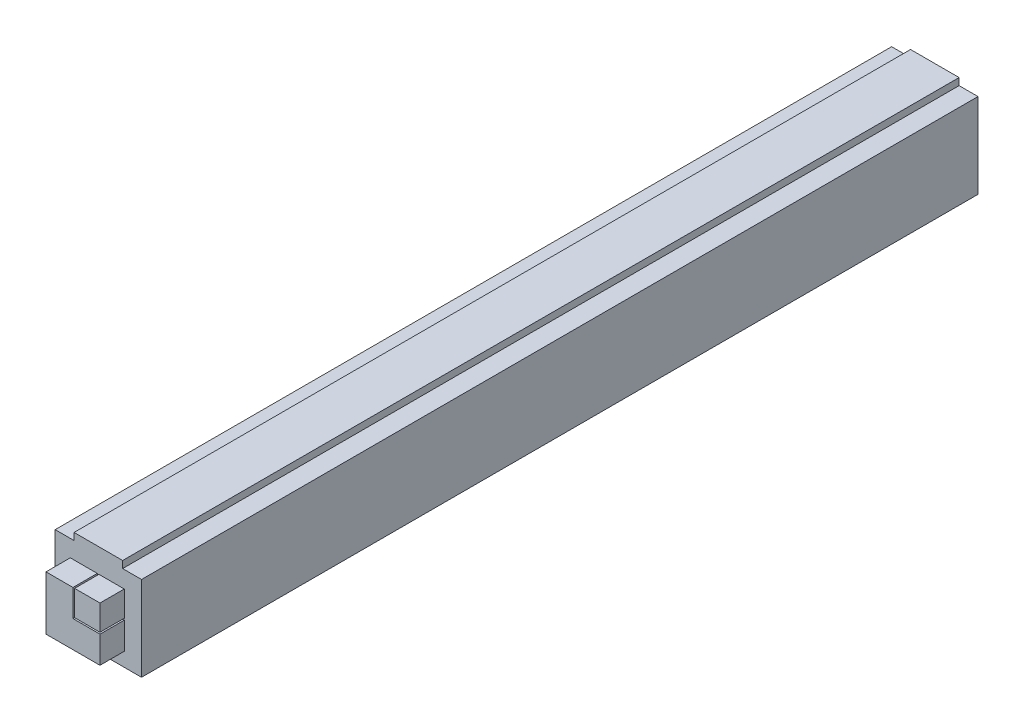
ISO-10303-21;
HEADER;
FILE_DESCRIPTION(('STEP AP214'),'2;1');
FILE_NAME('part.step','',(''),(''),'','','');
FILE_SCHEMA(('AUTOMOTIVE_DESIGN { 1 0 10303 214 1 1 1 1 }'));
ENDSEC;
DATA;
#1=APPLICATION_CONTEXT('core data for automotive mechanical design processes');
#2=APPLICATION_PROTOCOL_DEFINITION('international standard','automotive_design',2000,#1);
#3=PRODUCT_CONTEXT('',#1,'mechanical');
#4=PRODUCT('Part','Part','',(#3));
#5=PRODUCT_RELATED_PRODUCT_CATEGORY('part','',(#4));
#6=PRODUCT_DEFINITION_FORMATION('','',#4);
#7=PRODUCT_DEFINITION_CONTEXT('part definition',#1,'design');
#8=PRODUCT_DEFINITION('design','',#6,#7);
#9=PRODUCT_DEFINITION_SHAPE('','',#8);
#10=(LENGTH_UNIT() NAMED_UNIT(*) SI_UNIT(.MILLI.,.METRE.));
#11=(NAMED_UNIT(*) PLANE_ANGLE_UNIT() SI_UNIT($,.RADIAN.));
#12=(NAMED_UNIT(*) SI_UNIT($,.STERADIAN.) SOLID_ANGLE_UNIT());
#13=UNCERTAINTY_MEASURE_WITH_UNIT(LENGTH_MEASURE(1.E-05),#10,'distance_accuracy_value','');
#14=(GEOMETRIC_REPRESENTATION_CONTEXT(3) GLOBAL_UNCERTAINTY_ASSIGNED_CONTEXT((#13)) GLOBAL_UNIT_ASSIGNED_CONTEXT((#10,
#11,#12)) REPRESENTATION_CONTEXT('',''));
#15=CARTESIAN_POINT('',(0.,0.,0.));
#16=DIRECTION('',(0.,0.,1.));
#17=DIRECTION('',(1.,0.,0.));
#18=AXIS2_PLACEMENT_3D('',#15,#16,#17);
#19=CARTESIAN_POINT('',(0.30139237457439,25.5354081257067,-0.300000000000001));
#20=DIRECTION('',(0.,-1.,0.));
#21=DIRECTION('',(0.,0.,-1.));
#22=AXIS2_PLACEMENT_3D('',#19,#20,#21);
#23=PLANE('',#22);
#24=DIRECTION('',(-1.,0.,0.));
#25=VECTOR('',#24,1.);
#26=CARTESIAN_POINT('',(0.30139237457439,25.5354081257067,-4.8));
#27=LINE('',#26,#25);
#28=CARTESIAN_POINT('',(5.,25.5354081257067,-4.8));
#29=VERTEX_POINT('',#28);
#30=CARTESIAN_POINT('',(0.30139237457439,25.5354081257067,-4.8));
#31=VERTEX_POINT('',#30);
#32=EDGE_CURVE('E108',#29,#31,#27,.T.);
#33=ORIENTED_EDGE('',*,*,#32,.T.);
#34=DIRECTION('',(0.,0.,-1.));
#35=VECTOR('',#34,1.);
#36=CARTESIAN_POINT('',(0.30139237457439,25.5354081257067,-0.300000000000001));
#37=LINE('',#36,#35);
#38=CARTESIAN_POINT('',(0.30139237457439,25.5354081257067,-0.300000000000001));
#39=VERTEX_POINT('',#38);
#40=EDGE_CURVE('E12',#39,#31,#37,.T.);
#41=ORIENTED_EDGE('',*,*,#40,.F.);
#42=DIRECTION('',(-1.,0.,0.));
#43=VECTOR('',#42,1.);
#44=CARTESIAN_POINT('',(0.30139237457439,25.5354081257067,-0.300000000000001));
#45=LINE('',#44,#43);
#46=CARTESIAN_POINT('',(5.,25.5354081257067,-0.300000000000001));
#47=VERTEX_POINT('',#46);
#48=EDGE_CURVE('E96',#47,#39,#45,.T.);
#49=ORIENTED_EDGE('',*,*,#48,.F.);
#50=DIRECTION('',(0.,0.,-1.));
#51=VECTOR('',#50,1.);
#52=CARTESIAN_POINT('',(5.,25.5354081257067,-0.300000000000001));
#53=LINE('',#52,#51);
#54=EDGE_CURVE('E104',#47,#29,#53,.T.);
#55=ORIENTED_EDGE('',*,*,#54,.T.);
#56=EDGE_LOOP('',(#33,#41,#49,#55));
#57=FACE_BOUND('',#56,.T.);
#58=ADVANCED_FACE('F45',(#57),#23,.F.);
#59=CARTESIAN_POINT('',(0.30139237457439,25.5354081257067,-0.300000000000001));
#60=DIRECTION('',(1.,0.,0.));
#61=DIRECTION('',(0.,1.,0.));
#62=AXIS2_PLACEMENT_3D('',#59,#60,#61);
#63=PLANE('',#62);
#64=DIRECTION('',(0.,-1.,0.));
#65=VECTOR('',#64,1.);
#66=CARTESIAN_POINT('',(0.30139237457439,25.5354081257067,-4.8));
#67=LINE('',#66,#65);
#68=CARTESIAN_POINT('',(0.301392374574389,20.836800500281,-4.8));
#69=VERTEX_POINT('',#68);
#70=EDGE_CURVE('E100',#31,#69,#67,.T.);
#71=ORIENTED_EDGE('',*,*,#70,.T.);
#72=DIRECTION('',(0.,0.,-1.));
#73=VECTOR('',#72,1.);
#74=CARTESIAN_POINT('',(0.301392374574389,20.836800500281,-0.300000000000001));
#75=LINE('',#74,#73);
#76=CARTESIAN_POINT('',(0.301392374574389,20.836800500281,-0.300000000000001));
#77=VERTEX_POINT('',#76);
#78=EDGE_CURVE('E53',#77,#69,#75,.T.);
#79=ORIENTED_EDGE('',*,*,#78,.F.);
#80=DIRECTION('',(0.,-1.,0.));
#81=VECTOR('',#80,1.);
#82=CARTESIAN_POINT('',(0.30139237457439,25.5354081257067,-0.300000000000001));
#83=LINE('',#82,#81);
#84=EDGE_CURVE('E91',#39,#77,#83,.T.);
#85=ORIENTED_EDGE('',*,*,#84,.F.);
#86=ORIENTED_EDGE('',*,*,#40,.T.);
#87=EDGE_LOOP('',(#71,#79,#85,#86));
#88=FACE_BOUND('',#87,.T.);
#89=ADVANCED_FACE('F99',(#88),#63,.F.);
#90=CARTESIAN_POINT('',(0.301392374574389,20.836800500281,-0.300000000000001));
#91=DIRECTION('',(0.,1.,0.));
#92=DIRECTION('',(0.,0.,1.));
#93=AXIS2_PLACEMENT_3D('',#90,#91,#92);
#94=PLANE('',#93);
#95=DIRECTION('',(1.,0.,0.));
#96=VECTOR('',#95,1.);
#97=CARTESIAN_POINT('',(0.301392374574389,20.836800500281,-4.8));
#98=LINE('',#97,#96);
#99=CARTESIAN_POINT('',(5.,20.836800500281,-4.8));
#100=VERTEX_POINT('',#99);
#101=EDGE_CURVE('E78',#69,#100,#98,.T.);
#102=ORIENTED_EDGE('',*,*,#101,.T.);
#103=DIRECTION('',(0.,0.,-1.));
#104=VECTOR('',#103,1.);
#105=CARTESIAN_POINT('',(5.,20.836800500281,-0.300000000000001));
#106=LINE('',#105,#104);
#107=CARTESIAN_POINT('',(5.,20.836800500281,-0.300000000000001));
#108=VERTEX_POINT('',#107);
#109=EDGE_CURVE('E101',#108,#100,#106,.T.);
#110=ORIENTED_EDGE('',*,*,#109,.F.);
#111=DIRECTION('',(1.,0.,0.));
#112=VECTOR('',#111,1.);
#113=CARTESIAN_POINT('',(0.301392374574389,20.836800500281,-0.300000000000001));
#114=LINE('',#113,#112);
#115=EDGE_CURVE('E94',#77,#108,#114,.T.);
#116=ORIENTED_EDGE('',*,*,#115,.F.);
#117=ORIENTED_EDGE('',*,*,#78,.T.);
#118=EDGE_LOOP('',(#102,#110,#116,#117));
#119=FACE_BOUND('',#118,.T.);
#120=ADVANCED_FACE('F102',(#119),#94,.F.);
#121=CARTESIAN_POINT('',(5.,25.5354081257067,-0.300000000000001));
#122=DIRECTION('',(-1.,0.,0.));
#123=DIRECTION('',(0.,-1.,0.));
#124=AXIS2_PLACEMENT_3D('',#121,#122,#123);
#125=PLANE('',#124);
#126=DIRECTION('',(0.,1.,0.));
#127=VECTOR('',#126,1.);
#128=CARTESIAN_POINT('',(5.,25.5354081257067,-4.8));
#129=LINE('',#128,#127);
#130=EDGE_CURVE('E84',#100,#29,#129,.T.);
#131=ORIENTED_EDGE('',*,*,#130,.T.);
#132=ORIENTED_EDGE('',*,*,#54,.F.);
#133=DIRECTION('',(0.,1.,0.));
#134=VECTOR('',#133,1.);
#135=CARTESIAN_POINT('',(5.,25.5354081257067,-0.300000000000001));
#136=LINE('',#135,#134);
#137=EDGE_CURVE('E61',#108,#47,#136,.T.);
#138=ORIENTED_EDGE('',*,*,#137,.F.);
#139=ORIENTED_EDGE('',*,*,#109,.T.);
#140=EDGE_LOOP('',(#131,#132,#138,#139));
#141=FACE_BOUND('',#140,.T.);
#142=ADVANCED_FACE('F115',(#141),#125,.F.);
#143=CARTESIAN_POINT('',(0.,0.,-0.300000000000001));
#144=DIRECTION('',(0.,0.,-1.));
#145=DIRECTION('',(-1.,0.,0.));
#146=AXIS2_PLACEMENT_3D('',#143,#144,#145);
#147=PLANE('',#146);
#148=ORIENTED_EDGE('',*,*,#48,.T.);
#149=ORIENTED_EDGE('',*,*,#84,.T.);
#150=ORIENTED_EDGE('',*,*,#115,.T.);
#151=ORIENTED_EDGE('',*,*,#137,.T.);
#152=EDGE_LOOP('',(#148,#149,#150,#151));
#153=FACE_BOUND('',#152,.T.);
#154=ADVANCED_FACE('F92',(#153),#147,.F.);
#155=CARTESIAN_POINT('',(0.,0.,-4.8));
#156=DIRECTION('',(0.,0.,-1.));
#157=DIRECTION('',(-1.,0.,0.));
#158=AXIS2_PLACEMENT_3D('',#155,#156,#157);
#159=PLANE('',#158);
#160=ORIENTED_EDGE('',*,*,#32,.F.);
#161=ORIENTED_EDGE('',*,*,#130,.F.);
#162=ORIENTED_EDGE('',*,*,#101,.F.);
#163=ORIENTED_EDGE('',*,*,#70,.F.);
#164=EDGE_LOOP('',(#160,#161,#162,#163));
#165=FACE_BOUND('',#164,.T.);
#166=ADVANCED_FACE('F118',(#165),#159,.T.);
#167=CLOSED_SHELL('',(#58,#89,#120,#142,#154,#166));
#168=MANIFOLD_SOLID_BREP('B2',#167);
#169=CARTESIAN_POINT('',(5.,20.5354081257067,-0.300000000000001));
#170=DIRECTION('',(-1.,0.,0.));
#171=DIRECTION('',(0.,-1.,0.));
#172=AXIS2_PLACEMENT_3D('',#169,#170,#171);
#173=PLANE('',#172);
#174=DIRECTION('',(0.,1.,0.));
#175=VECTOR('',#174,1.);
#176=CARTESIAN_POINT('',(5.,20.5354081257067,-4.8));
#177=LINE('',#176,#175);
#178=CARTESIAN_POINT('',(5.,15.5354081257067,-4.8));
#179=VERTEX_POINT('',#178);
#180=CARTESIAN_POINT('',(5.,20.5354081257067,-4.8));
#181=VERTEX_POINT('',#180);
#182=EDGE_CURVE('E261',#179,#181,#177,.T.);
#183=ORIENTED_EDGE('',*,*,#182,.T.);
#184=DIRECTION('',(0.,0.,-1.));
#185=VECTOR('',#184,1.);
#186=CARTESIAN_POINT('',(5.,20.5354081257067,-0.300000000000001));
#187=LINE('',#186,#185);
#188=CARTESIAN_POINT('',(5.,20.5354081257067,-0.300000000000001));
#189=VERTEX_POINT('',#188);
#190=EDGE_CURVE('E43',#189,#181,#187,.T.);
#191=ORIENTED_EDGE('',*,*,#190,.F.);
#192=DIRECTION('',(0.,1.,0.));
#193=VECTOR('',#192,1.);
#194=CARTESIAN_POINT('',(5.,20.5354081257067,-0.300000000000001));
#195=LINE('',#194,#193);
#196=CARTESIAN_POINT('',(5.,15.5354081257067,-0.300000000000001));
#197=VERTEX_POINT('',#196);
#198=EDGE_CURVE('E271',#197,#189,#195,.T.);
#199=ORIENTED_EDGE('',*,*,#198,.F.);
#200=DIRECTION('',(0.,0.,-1.));
#201=VECTOR('',#200,1.);
#202=CARTESIAN_POINT('',(5.,15.5354081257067,-0.300000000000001));
#203=LINE('',#202,#201);
#204=EDGE_CURVE('E257',#197,#179,#203,.T.);
#205=ORIENTED_EDGE('',*,*,#204,.T.);
#206=EDGE_LOOP('',(#183,#191,#199,#205));
#207=FACE_BOUND('',#206,.T.);
#208=ADVANCED_FACE('F177',(#207),#173,.F.);
#209=CARTESIAN_POINT('',(0.,20.5354081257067,-0.300000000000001));
#210=DIRECTION('',(0.,-1.,0.));
#211=DIRECTION('',(1.,0.,0.));
#212=AXIS2_PLACEMENT_3D('',#209,#210,#211);
#213=PLANE('',#212);
#214=DIRECTION('',(-1.,0.,0.));
#215=VECTOR('',#214,1.);
#216=CARTESIAN_POINT('',(0.,20.5354081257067,-4.8));
#217=LINE('',#216,#215);
#218=CARTESIAN_POINT('',(0.,20.5354081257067,-4.8));
#219=VERTEX_POINT('',#218);
#220=EDGE_CURVE('E264',#181,#219,#217,.T.);
#221=ORIENTED_EDGE('',*,*,#220,.T.);
#222=DIRECTION('',(0.,0.,-1.));
#223=VECTOR('',#222,1.);
#224=CARTESIAN_POINT('',(0.,20.5354081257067,-0.300000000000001));
#225=LINE('',#224,#223);
#226=CARTESIAN_POINT('',(0.,20.5354081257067,-0.300000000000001));
#227=VERTEX_POINT('',#226);
#228=EDGE_CURVE('E185',#227,#219,#225,.T.);
#229=ORIENTED_EDGE('',*,*,#228,.F.);
#230=DIRECTION('',(-1.,0.,0.));
#231=VECTOR('',#230,1.);
#232=CARTESIAN_POINT('',(0.,20.5354081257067,-0.300000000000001));
#233=LINE('',#232,#231);
#234=EDGE_CURVE('E230',#189,#227,#233,.T.);
#235=ORIENTED_EDGE('',*,*,#234,.F.);
#236=ORIENTED_EDGE('',*,*,#190,.T.);
#237=EDGE_LOOP('',(#221,#229,#235,#236));
#238=FACE_BOUND('',#237,.T.);
#239=ADVANCED_FACE('F295',(#238),#213,.F.);
#240=CARTESIAN_POINT('',(0.,25.5354081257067,-0.300000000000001));
#241=DIRECTION('',(-1.,0.,0.));
#242=DIRECTION('',(0.,-1.,0.));
#243=AXIS2_PLACEMENT_3D('',#240,#241,#242);
#244=PLANE('',#243);
#245=DIRECTION('',(0.,1.,0.));
#246=VECTOR('',#245,1.);
#247=CARTESIAN_POINT('',(0.,25.5354081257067,-4.8));
#248=LINE('',#247,#246);
#249=CARTESIAN_POINT('',(0.,25.5354081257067,-4.8));
#250=VERTEX_POINT('',#249);
#251=EDGE_CURVE('E266',#219,#250,#248,.T.);
#252=ORIENTED_EDGE('',*,*,#251,.T.);
#253=DIRECTION('',(0.,0.,-1.));
#254=VECTOR('',#253,1.);
#255=CARTESIAN_POINT('',(0.,25.5354081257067,-0.300000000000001));
#256=LINE('',#255,#254);
#257=CARTESIAN_POINT('',(0.,25.5354081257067,-0.300000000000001));
#258=VERTEX_POINT('',#257);
#259=EDGE_CURVE('E252',#258,#250,#256,.T.);
#260=ORIENTED_EDGE('',*,*,#259,.F.);
#261=DIRECTION('',(0.,1.,0.));
#262=VECTOR('',#261,1.);
#263=CARTESIAN_POINT('',(0.,25.5354081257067,-0.300000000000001));
#264=LINE('',#263,#262);
#265=EDGE_CURVE('E243',#227,#258,#264,.T.);
#266=ORIENTED_EDGE('',*,*,#265,.F.);
#267=ORIENTED_EDGE('',*,*,#228,.T.);
#268=EDGE_LOOP('',(#252,#260,#266,#267));
#269=FACE_BOUND('',#268,.T.);
#270=ADVANCED_FACE('F277',(#269),#244,.F.);
#271=CARTESIAN_POINT('',(-5.,25.5354081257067,-0.300000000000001));
#272=DIRECTION('',(0.,-1.,0.));
#273=DIRECTION('',(0.,0.,-1.));
#274=AXIS2_PLACEMENT_3D('',#271,#272,#273);
#275=PLANE('',#274);
#276=DIRECTION('',(-1.,0.,0.));
#277=VECTOR('',#276,1.);
#278=CARTESIAN_POINT('',(-5.,25.5354081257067,-4.8));
#279=LINE('',#278,#277);
#280=CARTESIAN_POINT('',(-5.,25.5354081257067,-4.8));
#281=VERTEX_POINT('',#280);
#282=EDGE_CURVE('E251',#250,#281,#279,.T.);
#283=ORIENTED_EDGE('',*,*,#282,.T.);
#284=DIRECTION('',(0.,0.,-1.));
#285=VECTOR('',#284,1.);
#286=CARTESIAN_POINT('',(-5.,25.5354081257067,-0.300000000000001));
#287=LINE('',#286,#285);
#288=CARTESIAN_POINT('',(-5.,25.5354081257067,-0.300000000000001));
#289=VERTEX_POINT('',#288);
#290=EDGE_CURVE('E248',#289,#281,#287,.T.);
#291=ORIENTED_EDGE('',*,*,#290,.F.);
#292=DIRECTION('',(-1.,0.,0.));
#293=VECTOR('',#292,1.);
#294=CARTESIAN_POINT('',(-5.,25.5354081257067,-0.300000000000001));
#295=LINE('',#294,#293);
#296=EDGE_CURVE('E237',#258,#289,#295,.T.);
#297=ORIENTED_EDGE('',*,*,#296,.F.);
#298=ORIENTED_EDGE('',*,*,#259,.T.);
#299=EDGE_LOOP('',(#283,#291,#297,#298));
#300=FACE_BOUND('',#299,.T.);
#301=ADVANCED_FACE('F249',(#300),#275,.F.);
#302=CARTESIAN_POINT('',(-5.,25.5354081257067,-0.300000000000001));
#303=DIRECTION('',(1.,0.,0.));
#304=DIRECTION('',(0.,0.,-1.));
#305=AXIS2_PLACEMENT_3D('',#302,#303,#304);
#306=PLANE('',#305);
#307=DIRECTION('',(0.,-1.,0.));
#308=VECTOR('',#307,1.);
#309=CARTESIAN_POINT('',(-5.,25.5354081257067,-4.8));
#310=LINE('',#309,#308);
#311=CARTESIAN_POINT('',(-5.,15.5354081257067,-4.8));
#312=VERTEX_POINT('',#311);
#313=EDGE_CURVE('E216',#281,#312,#310,.T.);
#314=ORIENTED_EDGE('',*,*,#313,.T.);
#315=DIRECTION('',(0.,0.,-1.));
#316=VECTOR('',#315,1.);
#317=CARTESIAN_POINT('',(-5.,15.5354081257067,-0.300000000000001));
#318=LINE('',#317,#316);
#319=CARTESIAN_POINT('',(-5.,15.5354081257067,-0.300000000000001));
#320=VERTEX_POINT('',#319);
#321=EDGE_CURVE('E253',#320,#312,#318,.T.);
#322=ORIENTED_EDGE('',*,*,#321,.F.);
#323=DIRECTION('',(0.,-1.,0.));
#324=VECTOR('',#323,1.);
#325=CARTESIAN_POINT('',(-5.,25.5354081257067,-0.300000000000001));
#326=LINE('',#325,#324);
#327=EDGE_CURVE('E241',#289,#320,#326,.T.);
#328=ORIENTED_EDGE('',*,*,#327,.F.);
#329=ORIENTED_EDGE('',*,*,#290,.T.);
#330=EDGE_LOOP('',(#314,#322,#328,#329));
#331=FACE_BOUND('',#330,.T.);
#332=ADVANCED_FACE('F255',(#331),#306,.F.);
#333=CARTESIAN_POINT('',(-5.,15.5354081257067,-0.300000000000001));
#334=DIRECTION('',(0.,1.,0.));
#335=DIRECTION('',(0.,0.,1.));
#336=AXIS2_PLACEMENT_3D('',#333,#334,#335);
#337=PLANE('',#336);
#338=DIRECTION('',(1.,0.,0.));
#339=VECTOR('',#338,1.);
#340=CARTESIAN_POINT('',(-5.,15.5354081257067,-4.8));
#341=LINE('',#340,#339);
#342=EDGE_CURVE('E222',#312,#179,#341,.T.);
#343=ORIENTED_EDGE('',*,*,#342,.T.);
#344=ORIENTED_EDGE('',*,*,#204,.F.);
#345=DIRECTION('',(1.,0.,0.));
#346=VECTOR('',#345,1.);
#347=CARTESIAN_POINT('',(-5.,15.5354081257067,-0.300000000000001));
#348=LINE('',#347,#346);
#349=EDGE_CURVE('E193',#320,#197,#348,.T.);
#350=ORIENTED_EDGE('',*,*,#349,.F.);
#351=ORIENTED_EDGE('',*,*,#321,.T.);
#352=EDGE_LOOP('',(#343,#344,#350,#351));
#353=FACE_BOUND('',#352,.T.);
#354=ADVANCED_FACE('F284',(#353),#337,.F.);
#355=CARTESIAN_POINT('',(0.,0.,-0.300000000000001));
#356=DIRECTION('',(0.,0.,1.));
#357=DIRECTION('',(1.,0.,0.));
#358=AXIS2_PLACEMENT_3D('',#355,#356,#357);
#359=PLANE('',#358);
#360=ORIENTED_EDGE('',*,*,#198,.T.);
#361=ORIENTED_EDGE('',*,*,#234,.T.);
#362=ORIENTED_EDGE('',*,*,#265,.T.);
#363=ORIENTED_EDGE('',*,*,#296,.T.);
#364=ORIENTED_EDGE('',*,*,#327,.T.);
#365=ORIENTED_EDGE('',*,*,#349,.T.);
#366=EDGE_LOOP('',(#360,#361,#362,#363,#364,#365));
#367=FACE_BOUND('',#366,.T.);
#368=ADVANCED_FACE('F239',(#367),#359,.T.);
#369=CARTESIAN_POINT('',(0.,0.,-4.8));
#370=DIRECTION('',(0.,0.,1.));
#371=DIRECTION('',(1.,0.,0.));
#372=AXIS2_PLACEMENT_3D('',#369,#370,#371);
#373=PLANE('',#372);
#374=ORIENTED_EDGE('',*,*,#182,.F.);
#375=ORIENTED_EDGE('',*,*,#342,.F.);
#376=ORIENTED_EDGE('',*,*,#313,.F.);
#377=ORIENTED_EDGE('',*,*,#282,.F.);
#378=ORIENTED_EDGE('',*,*,#251,.F.);
#379=ORIENTED_EDGE('',*,*,#220,.F.);
#380=EDGE_LOOP('',(#374,#375,#376,#377,#378,#379));
#381=FACE_BOUND('',#380,.T.);
#382=ADVANCED_FACE('F280',(#381),#373,.F.);
#383=CLOSED_SHELL('',(#208,#239,#270,#301,#332,#354,#368,#382));
#384=MANIFOLD_SOLID_BREP('B6',#383);
#385=CARTESIAN_POINT('',(7.99999999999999,28.4606508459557,-160.));
#386=DIRECTION('',(1.,0.,0.));
#387=DIRECTION('',(0.,1.,0.));
#388=AXIS2_PLACEMENT_3D('',#385,#386,#387);
#389=PLANE('',#388);
#390=DIRECTION('',(0.,1.,0.));
#391=VECTOR('',#390,1.);
#392=CARTESIAN_POINT('',(7.99999999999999,28.4606508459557,-5.));
#393=LINE('',#392,#391);
#394=CARTESIAN_POINT('',(8.,12.7606508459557,-5.));
#395=VERTEX_POINT('',#394);
#396=CARTESIAN_POINT('',(7.99999999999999,28.4606508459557,-5.));
#397=VERTEX_POINT('',#396);
#398=EDGE_CURVE('E449',#395,#397,#393,.T.);
#399=ORIENTED_EDGE('',*,*,#398,.F.);
#400=DIRECTION('',(0.,0.,1.));
#401=VECTOR('',#400,1.);
#402=CARTESIAN_POINT('',(8.,12.7606508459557,-160.));
#403=LINE('',#402,#401);
#404=CARTESIAN_POINT('',(8.,12.7606508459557,-160.));
#405=VERTEX_POINT('',#404);
#406=EDGE_CURVE('E175',#405,#395,#403,.T.);
#407=ORIENTED_EDGE('',*,*,#406,.F.);
#408=DIRECTION('',(0.,1.,0.));
#409=VECTOR('',#408,1.);
#410=CARTESIAN_POINT('',(7.99999999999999,28.4606508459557,-160.));
#411=LINE('',#410,#409);
#412=CARTESIAN_POINT('',(7.99999999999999,28.4606508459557,-160.));
#413=VERTEX_POINT('',#412);
#414=EDGE_CURVE('E470',#405,#413,#411,.T.);
#415=ORIENTED_EDGE('',*,*,#414,.T.);
#416=DIRECTION('',(0.,0.,1.));
#417=VECTOR('',#416,1.);
#418=CARTESIAN_POINT('',(7.99999999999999,28.4606508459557,-160.));
#419=LINE('',#418,#417);
#420=EDGE_CURVE('E355',#413,#397,#419,.T.);
#421=ORIENTED_EDGE('',*,*,#420,.T.);
#422=EDGE_LOOP('',(#399,#407,#415,#421));
#423=FACE_BOUND('',#422,.T.);
#424=ADVANCED_FACE('F352',(#423),#389,.T.);
#425=CARTESIAN_POINT('',(-8.,12.7606508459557,-160.));
#426=DIRECTION('',(0.,-1.,0.));
#427=DIRECTION('',(0.,0.,-1.));
#428=AXIS2_PLACEMENT_3D('',#425,#426,#427);
#429=PLANE('',#428);
#430=CARTESIAN_POINT('',(0.,12.7606508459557,-82.4));
#431=DIRECTION('',(0.,-1.,0.));
#432=DIRECTION('',(0.,0.,-1.));
#433=AXIS2_PLACEMENT_3D('',#430,#431,#432);
#434=CIRCLE('',#433,6.65);
#435=CARTESIAN_POINT('',(0.,12.7606508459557,-89.05));
#436=VERTEX_POINT('',#435);
#437=EDGE_CURVE('E527',#436,#436,#434,.T.);
#438=ORIENTED_EDGE('',*,*,#437,.F.);
#439=EDGE_LOOP('',(#438));
#440=FACE_BOUND('',#439,.T.);
#441=DIRECTION('',(1.,0.,0.));
#442=VECTOR('',#441,1.);
#443=CARTESIAN_POINT('',(-8.,12.7606508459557,-5.));
#444=LINE('',#443,#442);
#445=CARTESIAN_POINT('',(-8.,12.7606508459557,-5.));
#446=VERTEX_POINT('',#445);
#447=EDGE_CURVE('E468',#446,#395,#444,.T.);
#448=ORIENTED_EDGE('',*,*,#447,.F.);
#449=DIRECTION('',(0.,0.,1.));
#450=VECTOR('',#449,1.);
#451=CARTESIAN_POINT('',(-8.,12.7606508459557,-160.));
#452=LINE('',#451,#450);
#453=CARTESIAN_POINT('',(-8.,12.7606508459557,-160.));
#454=VERTEX_POINT('',#453);
#455=EDGE_CURVE('E361',#454,#446,#452,.T.);
#456=ORIENTED_EDGE('',*,*,#455,.F.);
#457=DIRECTION('',(1.,0.,0.));
#458=VECTOR('',#457,1.);
#459=CARTESIAN_POINT('',(-8.,12.7606508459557,-160.));
#460=LINE('',#459,#458);
#461=EDGE_CURVE('E439',#454,#405,#460,.T.);
#462=ORIENTED_EDGE('',*,*,#461,.T.);
#463=ORIENTED_EDGE('',*,*,#406,.T.);
#464=EDGE_LOOP('',(#448,#456,#462,#463));
#465=FACE_BOUND('',#464,.T.);
#466=ADVANCED_FACE('F482',(#440,#465),#429,.T.);
#467=CARTESIAN_POINT('',(-8.,28.4606508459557,-160.));
#468=DIRECTION('',(-1.,0.,0.));
#469=DIRECTION('',(0.,-1.,0.));
#470=AXIS2_PLACEMENT_3D('',#467,#468,#469);
#471=PLANE('',#470);
#472=DIRECTION('',(0.,-1.,0.));
#473=VECTOR('',#472,1.);
#474=CARTESIAN_POINT('',(-8.,28.4606508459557,-5.));
#475=LINE('',#474,#473);
#476=CARTESIAN_POINT('',(-8.,28.4606508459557,-5.));
#477=VERTEX_POINT('',#476);
#478=EDGE_CURVE('E426',#477,#446,#475,.T.);
#479=ORIENTED_EDGE('',*,*,#478,.F.);
#480=DIRECTION('',(0.,0.,1.));
#481=VECTOR('',#480,1.);
#482=CARTESIAN_POINT('',(-8.,28.4606508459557,-160.));
#483=LINE('',#482,#481);
#484=CARTESIAN_POINT('',(-8.,28.4606508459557,-160.));
#485=VERTEX_POINT('',#484);
#486=EDGE_CURVE('E421',#485,#477,#483,.T.);
#487=ORIENTED_EDGE('',*,*,#486,.F.);
#488=DIRECTION('',(0.,-1.,0.));
#489=VECTOR('',#488,1.);
#490=CARTESIAN_POINT('',(-8.,28.4606508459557,-160.));
#491=LINE('',#490,#489);
#492=EDGE_CURVE('E424',#485,#454,#491,.T.);
#493=ORIENTED_EDGE('',*,*,#492,.T.);
#494=ORIENTED_EDGE('',*,*,#455,.T.);
#495=EDGE_LOOP('',(#479,#487,#493,#494));
#496=FACE_BOUND('',#495,.T.);
#497=ADVANCED_FACE('F423',(#496),#471,.T.);
#498=CARTESIAN_POINT('',(-4.5,28.4606508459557,-160.));
#499=DIRECTION('',(0.,1.,0.));
#500=DIRECTION('',(0.,0.,1.));
#501=AXIS2_PLACEMENT_3D('',#498,#499,#500);
#502=PLANE('',#501);
#503=DIRECTION('',(-1.,0.,0.));
#504=VECTOR('',#503,1.);
#505=CARTESIAN_POINT('',(-4.5,28.4606508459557,-5.));
#506=LINE('',#505,#504);
#507=CARTESIAN_POINT('',(-4.5,28.4606508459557,-5.));
#508=VERTEX_POINT('',#507);
#509=EDGE_CURVE('E465',#508,#477,#506,.T.);
#510=ORIENTED_EDGE('',*,*,#509,.F.);
#511=DIRECTION('',(0.,0.,1.));
#512=VECTOR('',#511,1.);
#513=CARTESIAN_POINT('',(-4.5,28.4606508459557,-160.));
#514=LINE('',#513,#512);
#515=CARTESIAN_POINT('',(-4.5,28.4606508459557,-160.));
#516=VERTEX_POINT('',#515);
#517=EDGE_CURVE('E431',#516,#508,#514,.T.);
#518=ORIENTED_EDGE('',*,*,#517,.F.);
#519=DIRECTION('',(-1.,0.,0.));
#520=VECTOR('',#519,1.);
#521=CARTESIAN_POINT('',(-4.5,28.4606508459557,-160.));
#522=LINE('',#521,#520);
#523=EDGE_CURVE('E437',#516,#485,#522,.T.);
#524=ORIENTED_EDGE('',*,*,#523,.T.);
#525=ORIENTED_EDGE('',*,*,#486,.T.);
#526=EDGE_LOOP('',(#510,#518,#524,#525));
#527=FACE_BOUND('',#526,.T.);
#528=ADVANCED_FACE('F441',(#527),#502,.T.);
#529=CARTESIAN_POINT('',(-4.5,29.7606508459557,-160.));
#530=DIRECTION('',(-1.,0.,0.));
#531=DIRECTION('',(0.,-1.,0.));
#532=AXIS2_PLACEMENT_3D('',#529,#530,#531);
#533=PLANE('',#532);
#534=DIRECTION('',(0.,-1.,0.));
#535=VECTOR('',#534,1.);
#536=CARTESIAN_POINT('',(-4.5,29.7606508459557,-5.));
#537=LINE('',#536,#535);
#538=CARTESIAN_POINT('',(-4.5,29.7606508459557,-5.));
#539=VERTEX_POINT('',#538);
#540=EDGE_CURVE('E462',#539,#508,#537,.T.);
#541=ORIENTED_EDGE('',*,*,#540,.F.);
#542=DIRECTION('',(0.,0.,1.));
#543=VECTOR('',#542,1.);
#544=CARTESIAN_POINT('',(-4.5,29.7606508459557,-160.));
#545=LINE('',#544,#543);
#546=CARTESIAN_POINT('',(-4.5,29.7606508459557,-160.));
#547=VERTEX_POINT('',#546);
#548=EDGE_CURVE('E474',#547,#539,#545,.T.);
#549=ORIENTED_EDGE('',*,*,#548,.F.);
#550=DIRECTION('',(0.,-1.,0.));
#551=VECTOR('',#550,1.);
#552=CARTESIAN_POINT('',(-4.5,29.7606508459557,-160.));
#553=LINE('',#552,#551);
#554=EDGE_CURVE('E442',#547,#516,#553,.T.);
#555=ORIENTED_EDGE('',*,*,#554,.T.);
#556=ORIENTED_EDGE('',*,*,#517,.T.);
#557=EDGE_LOOP('',(#541,#549,#555,#556));
#558=FACE_BOUND('',#557,.T.);
#559=ADVANCED_FACE('F497',(#558),#533,.T.);
#560=CARTESIAN_POINT('',(-4.5,29.7606508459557,-160.));
#561=DIRECTION('',(0.,1.,0.));
#562=DIRECTION('',(0.,0.,1.));
#563=AXIS2_PLACEMENT_3D('',#560,#561,#562);
#564=PLANE('',#563);
#565=DIRECTION('',(-1.,0.,0.));
#566=VECTOR('',#565,1.);
#567=CARTESIAN_POINT('',(-4.5,29.7606508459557,-5.));
#568=LINE('',#567,#566);
#569=CARTESIAN_POINT('',(4.49999999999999,29.7606508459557,-5.));
#570=VERTEX_POINT('',#569);
#571=EDGE_CURVE('E459',#570,#539,#568,.T.);
#572=ORIENTED_EDGE('',*,*,#571,.F.);
#573=DIRECTION('',(0.,0.,1.));
#574=VECTOR('',#573,1.);
#575=CARTESIAN_POINT('',(4.49999999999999,29.7606508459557,-160.));
#576=LINE('',#575,#574);
#577=CARTESIAN_POINT('',(4.49999999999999,29.7606508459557,-160.));
#578=VERTEX_POINT('',#577);
#579=EDGE_CURVE('E476',#578,#570,#576,.T.);
#580=ORIENTED_EDGE('',*,*,#579,.F.);
#581=DIRECTION('',(-1.,0.,0.));
#582=VECTOR('',#581,1.);
#583=CARTESIAN_POINT('',(-4.5,29.7606508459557,-160.));
#584=LINE('',#583,#582);
#585=EDGE_CURVE('E444',#578,#547,#584,.T.);
#586=ORIENTED_EDGE('',*,*,#585,.T.);
#587=ORIENTED_EDGE('',*,*,#548,.T.);
#588=EDGE_LOOP('',(#572,#580,#586,#587));
#589=FACE_BOUND('',#588,.T.);
#590=ADVANCED_FACE('F500',(#589),#564,.T.);
#591=CARTESIAN_POINT('',(4.49999999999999,29.7606508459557,-160.));
#592=DIRECTION('',(1.,0.,0.));
#593=DIRECTION('',(0.,1.,0.));
#594=AXIS2_PLACEMENT_3D('',#591,#592,#593);
#595=PLANE('',#594);
#596=DIRECTION('',(0.,1.,0.));
#597=VECTOR('',#596,1.);
#598=CARTESIAN_POINT('',(4.49999999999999,29.7606508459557,-5.));
#599=LINE('',#598,#597);
#600=CARTESIAN_POINT('',(4.49999999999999,28.4606508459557,-5.));
#601=VERTEX_POINT('',#600);
#602=EDGE_CURVE('E456',#601,#570,#599,.T.);
#603=ORIENTED_EDGE('',*,*,#602,.F.);
#604=DIRECTION('',(0.,0.,1.));
#605=VECTOR('',#604,1.);
#606=CARTESIAN_POINT('',(4.49999999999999,28.4606508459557,-160.));
#607=LINE('',#606,#605);
#608=CARTESIAN_POINT('',(4.49999999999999,28.4606508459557,-160.));
#609=VERTEX_POINT('',#608);
#610=EDGE_CURVE('E477',#609,#601,#607,.T.);
#611=ORIENTED_EDGE('',*,*,#610,.F.);
#612=DIRECTION('',(0.,1.,0.));
#613=VECTOR('',#612,1.);
#614=CARTESIAN_POINT('',(4.49999999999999,29.7606508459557,-160.));
#615=LINE('',#614,#613);
#616=EDGE_CURVE('E535',#609,#578,#615,.T.);
#617=ORIENTED_EDGE('',*,*,#616,.T.);
#618=ORIENTED_EDGE('',*,*,#579,.T.);
#619=EDGE_LOOP('',(#603,#611,#617,#618));
#620=FACE_BOUND('',#619,.T.);
#621=ADVANCED_FACE('F504',(#620),#595,.T.);
#622=CARTESIAN_POINT('',(4.49999999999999,28.4606508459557,-160.));
#623=DIRECTION('',(0.,1.,0.));
#624=DIRECTION('',(0.,0.,1.));
#625=AXIS2_PLACEMENT_3D('',#622,#623,#624);
#626=PLANE('',#625);
#627=DIRECTION('',(-1.,0.,0.));
#628=VECTOR('',#627,1.);
#629=CARTESIAN_POINT('',(4.49999999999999,28.4606508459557,-5.));
#630=LINE('',#629,#628);
#631=EDGE_CURVE('E452',#397,#601,#630,.T.);
#632=ORIENTED_EDGE('',*,*,#631,.F.);
#633=ORIENTED_EDGE('',*,*,#420,.F.);
#634=DIRECTION('',(-1.,0.,0.));
#635=VECTOR('',#634,1.);
#636=CARTESIAN_POINT('',(4.49999999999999,28.4606508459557,-160.));
#637=LINE('',#636,#635);
#638=EDGE_CURVE('E533',#413,#609,#637,.T.);
#639=ORIENTED_EDGE('',*,*,#638,.T.);
#640=ORIENTED_EDGE('',*,*,#610,.T.);
#641=EDGE_LOOP('',(#632,#633,#639,#640));
#642=FACE_BOUND('',#641,.T.);
#643=ADVANCED_FACE('F479',(#642),#626,.T.);
#644=CARTESIAN_POINT('',(0.,0.,-160.));
#645=DIRECTION('',(0.,0.,1.));
#646=DIRECTION('',(1.,0.,0.));
#647=AXIS2_PLACEMENT_3D('',#644,#645,#646);
#648=PLANE('',#647);
#649=ORIENTED_EDGE('',*,*,#414,.F.);
#650=ORIENTED_EDGE('',*,*,#461,.F.);
#651=ORIENTED_EDGE('',*,*,#492,.F.);
#652=ORIENTED_EDGE('',*,*,#523,.F.);
#653=ORIENTED_EDGE('',*,*,#554,.F.);
#654=ORIENTED_EDGE('',*,*,#585,.F.);
#655=ORIENTED_EDGE('',*,*,#616,.F.);
#656=ORIENTED_EDGE('',*,*,#638,.F.);
#657=EDGE_LOOP('',(#649,#650,#651,#652,#653,#654,#655,#656));
#658=FACE_BOUND('',#657,.T.);
#659=ADVANCED_FACE('F435',(#658),#648,.F.);
#660=CARTESIAN_POINT('',(0.,0.,-5.));
#661=DIRECTION('',(0.,0.,1.));
#662=DIRECTION('',(1.,0.,0.));
#663=AXIS2_PLACEMENT_3D('',#660,#661,#662);
#664=PLANE('',#663);
#665=ORIENTED_EDGE('',*,*,#398,.T.);
#666=ORIENTED_EDGE('',*,*,#631,.T.);
#667=ORIENTED_EDGE('',*,*,#602,.T.);
#668=ORIENTED_EDGE('',*,*,#571,.T.);
#669=ORIENTED_EDGE('',*,*,#540,.T.);
#670=ORIENTED_EDGE('',*,*,#509,.T.);
#671=ORIENTED_EDGE('',*,*,#478,.T.);
#672=ORIENTED_EDGE('',*,*,#447,.T.);
#673=EDGE_LOOP('',(#665,#666,#667,#668,#669,#670,#671,#672));
#674=FACE_BOUND('',#673,.T.);
#675=ADVANCED_FACE('F481',(#674),#664,.T.);
#676=CARTESIAN_POINT('',(0.,17.7606508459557,-82.4));
#677=DIRECTION('',(0.,-1.,0.));
#678=DIRECTION('',(0.,0.,-1.));
#679=AXIS2_PLACEMENT_3D('',#676,#677,#678);
#680=CYLINDRICAL_SURFACE('',#679,6.65);
#681=CARTESIAN_POINT('',(0.,17.7606508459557,-82.4));
#682=DIRECTION('',(0.,-1.,0.));
#683=DIRECTION('',(0.,0.,-1.));
#684=AXIS2_PLACEMENT_3D('',#681,#682,#683);
#685=CIRCLE('',#684,6.65);
#686=CARTESIAN_POINT('',(0.,17.7606508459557,-89.05));
#687=VERTEX_POINT('',#686);
#688=EDGE_CURVE('E453',#687,#687,#685,.T.);
#689=ORIENTED_EDGE('',*,*,#688,.F.);
#690=EDGE_LOOP('',(#689));
#691=FACE_BOUND('',#690,.T.);
#692=ORIENTED_EDGE('',*,*,#437,.T.);
#693=EDGE_LOOP('',(#692));
#694=FACE_BOUND('',#693,.T.);
#695=ADVANCED_FACE('F515',(#691,#694),#680,.F.);
#696=CARTESIAN_POINT('',(0.,17.7606508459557,-82.4));
#697=DIRECTION('',(0.,-1.,0.));
#698=DIRECTION('',(0.,0.,-1.));
#699=AXIS2_PLACEMENT_3D('',#696,#697,#698);
#700=PLANE('',#699);
#701=ORIENTED_EDGE('',*,*,#688,.T.);
#702=EDGE_LOOP('',(#701));
#703=FACE_BOUND('',#702,.T.);
#704=ADVANCED_FACE('F519',(#703),#700,.T.);
#705=CLOSED_SHELL('',(#424,#466,#497,#528,#559,#590,#621,#643,#659,#675,#695,#704));
#706=MANIFOLD_SOLID_BREP('B37',#705);
#707=ADVANCED_BREP_SHAPE_REPRESENTATION('',(#18,#168,#384,#706),#14);
#708=SHAPE_DEFINITION_REPRESENTATION(#9,#707);
ENDSEC;
END-ISO-10303-21;
